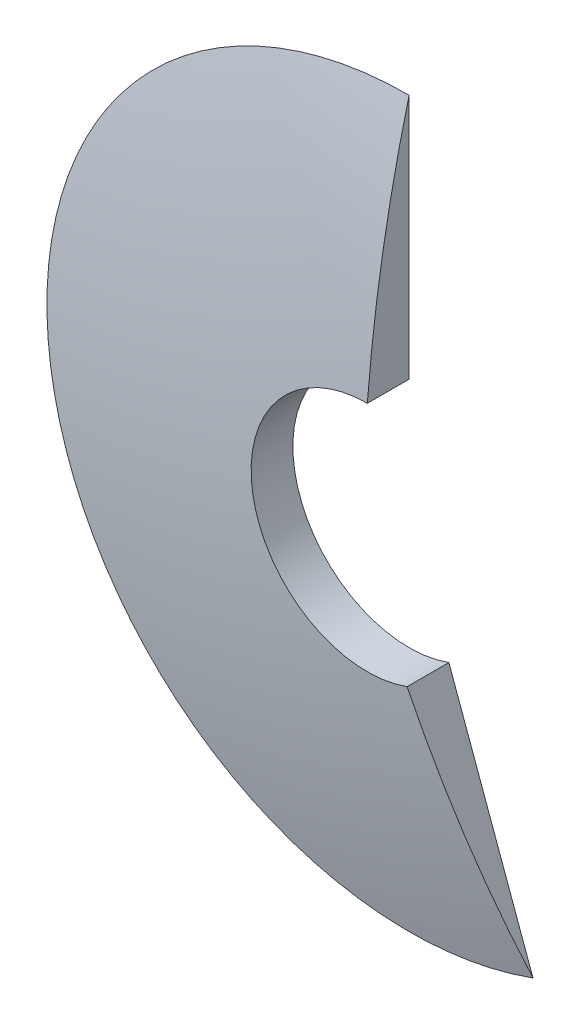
from build123d import *

# Parameters (mm, degrees)
SKICA1_R                 = 77.9
SKICA1_R_2               = 25
P_IDAT_VYSUNUT_M1_DEPTH  = 10
M_TKO1_SCALE             = 0.655
ODEBRAT_VYSUNUT_M1_DEPTH = 73.399138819


with BuildPart() as part:
    # Skica1 → P_idat vysunut_m1 (new body)
    with BuildSketch(Plane.XY):
        Circle(SKICA1_R)
        Circle(SKICA1_R_2, mode=Mode.SUBTRACT)
    extrude(amount=P_IDAT_VYSUNUT_M1_DEPTH)

    # Skica2 → Odebrat rotac_2 (revolve, cut)
    with BuildSketch(Plane(origin=(0, 0, 0), x_dir=(0, 0, -1), z_dir=(1, 0, 0))):
        with BuildLine():
            Line((-10, 0), (-24.202698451, 0))
            Line((-24.202698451, 0), (-24.202698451, 77.9))
            Line((-24.202698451, 77.9), (0, 77.9))
            ThreePointArc((0, 77.9), (-7.489784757, 39.269612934), (-10, 0))
        make_face()
    revolve(axis=Axis((0, 0, 10), (0, 0, 1)), mode=Mode.SUBTRACT)


with BuildPart() as part_1:
    # M_tko1: scaled about (0, 0, 0)
    add(part.part.scale(M_TKO1_SCALE))

    # Skica3 → Odebrat vysunut_m1 (cut, through all)
    with BuildSketch(Plane.XY):
        with BuildLine():
            Line((0, 60.661697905), (0, 0))
            Line((0, 0), (20.747522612, -57.003349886))
            ThreePointArc((20.747522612, -57.003349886), (49.691153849, -34.794120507), (60.661697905, 0))
            ThreePointArc((60.661697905, 0), (42.894297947, 42.894297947), (0, 60.661697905))
        make_face()
    extrude(amount=ODEBRAT_VYSUNUT_M1_DEPTH, mode=Mode.SUBTRACT)


solid = part_1.part
